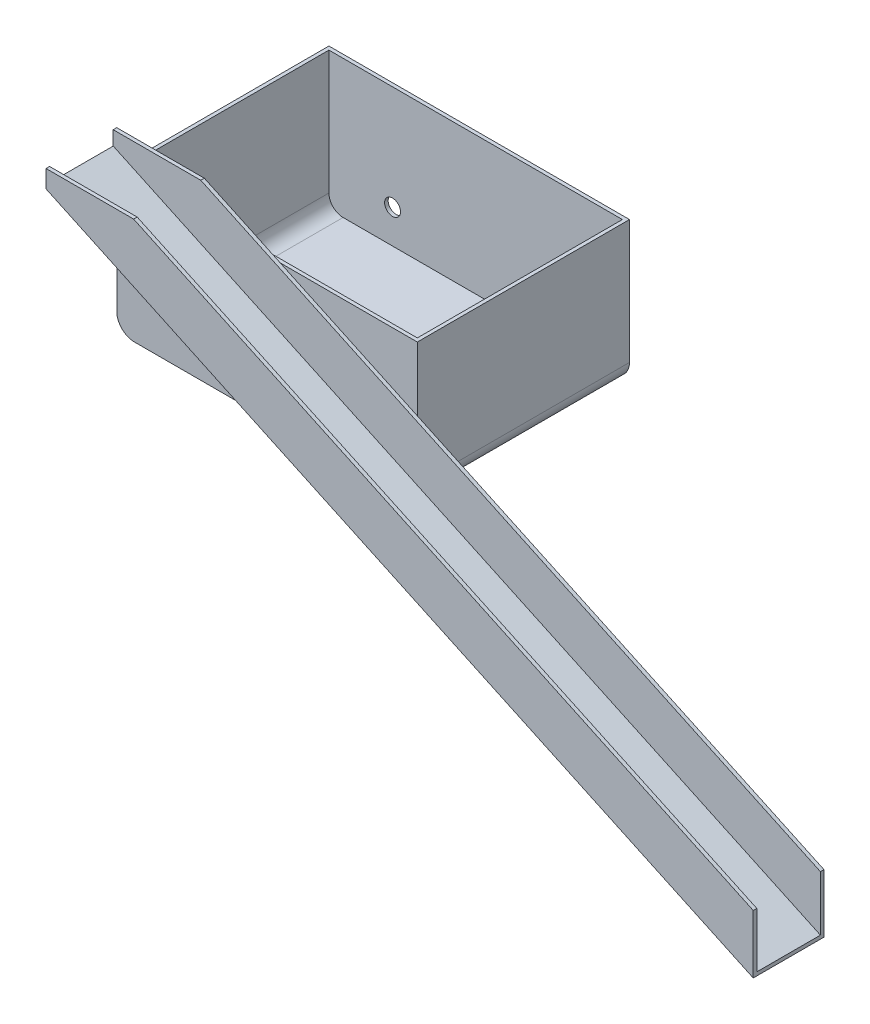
from build123d import *

# Parameters (mm, degrees)
EXTRUDE_1_DEPTH     = 60
FILLET_1_R          = 5
SHELL_1_T           = -1
EXTRUDE_2_DEPTH     = 20
SKETCH_3_W          = 18
SKETCH_3_H          = 24.103347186
SKETCH_5_R          = 2.25
CUT_EXTRUDE_1_DEPTH = 20


with BuildPart() as part:
    # Sketch 1 → Extrude 1 (new body)
    with BuildSketch(Plane.XY):
        Polygon((85, 88.261531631), (85, 70.176049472), (85, 53.625380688), (85, 48.261531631), (80, 48.261531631), (5, 48.261531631), (0, 48.261531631), (0, 53.261531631), (0, 88.261531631), align=None)
    extrude(amount=EXTRUDE_1_DEPTH)

    # Fillet 1
    fillet_1_edges = [part.edges().sort_by_distance(p)[0] for p in [
        (0, 48.261531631, 30),
        (85, 48.261531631, 30),
    ]]
    fillet(fillet_1_edges, radius=FILLET_1_R)

    # Shell 1
    shell_1_openings = [part.faces().sort_by_distance(p)[0] for p in [
        (42.5, 88.261531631, 30),
    ]]
    offset(amount=SHELL_1_T, openings=shell_1_openings, kind=Kind.INTERSECTION)

    # Sketch 2 → Extrude 2 (add)
    with BuildSketch(Plane.XY.offset(60)):
        Polygon((0, 93.261531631), (200, 0), (200, 16.550668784), (24.770489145, 98.261531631), (0, 98.261531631), align=None)
    extrude(amount=EXTRUDE_2_DEPTH)

    # Sweep 1: sweep along a path in Sketch 4
    with BuildLine(Plane.XY.offset(80)) as sweep_1_path:
        Line((200, 0), (0, 93.261531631))
    # Sketch 3 → Sweep 1 (sweep, cut)
    with BuildSketch(Plane(origin=(200, 0, 0), x_dir=(0, 0, -1), z_dir=(1, 0, 0))):
        with Locations((-70, 13.051673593)):
            Rectangle(SKETCH_3_W, SKETCH_3_H)
    sweep(path=sweep_1_path.line, mode=Mode.SUBTRACT)

    # Sketch 5 → Cut-Extrude 1 (cut)
    with BuildSketch(Plane.XY.offset(1)):
        with Locations((19, 58.761531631)):
            Circle(SKETCH_5_R)
        with Locations((66, 58.761531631)):
            Circle(SKETCH_5_R)
    extrude(amount=-CUT_EXTRUDE_1_DEPTH, mode=Mode.SUBTRACT)


solid = part.part
